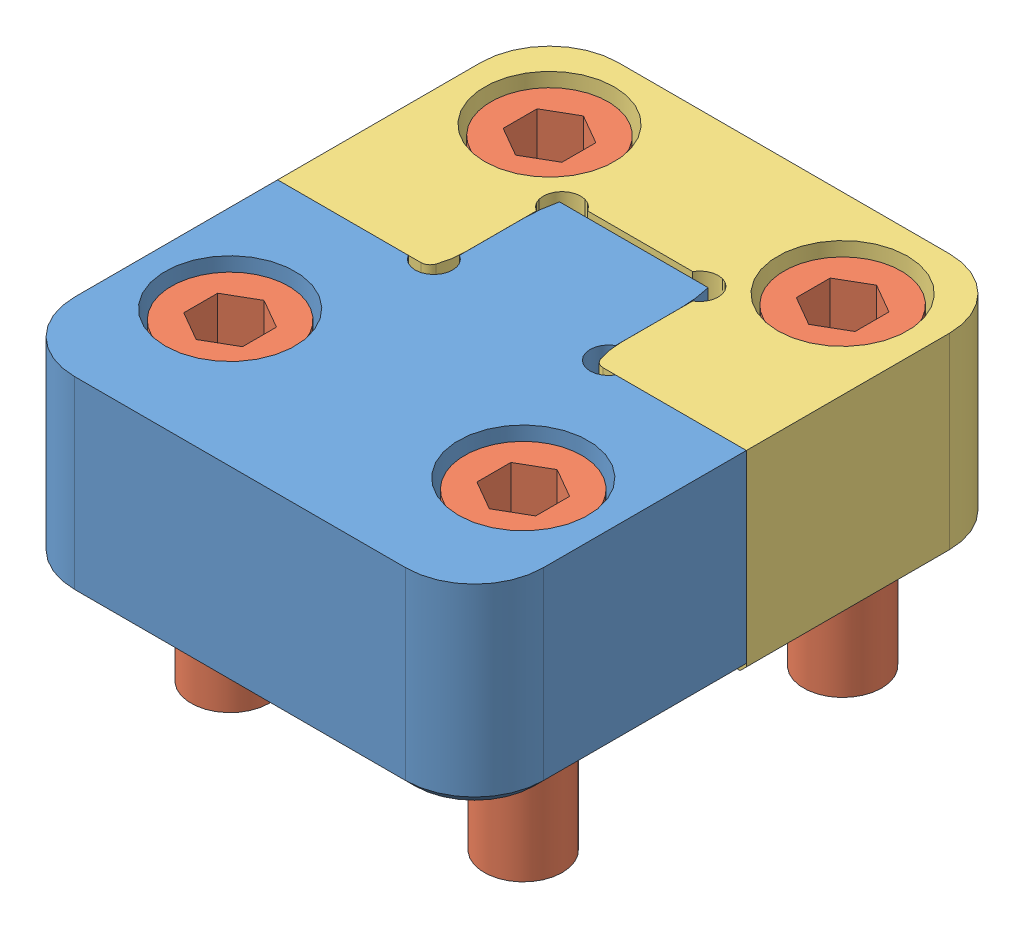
SolidWorks assembly SL62X150.SLDASM, configuration Default (file format 13000). Lengths in mm.
Overall size (38.1 26.2 44.2).
8 component instances, 3 part files, 6 mates.
Components (placement in the parent):
- SL62X150-M-1: SL62X150-M.SLDASM [Default] at origin size (38.1 26.2 32)
  - SL62X150 MALE-1: SL62X150 MALE.sldprt [Default] at origin size (38.1 15.75 32)
  - SHCS25-20L.75-1: SHCS25-20L.75.sldprt [SHCS25-20L.75] at (11.9126 -7.145 10.9982) x (1 0 0) z (0 -1 0) size (9.53 9.53 25.4)
  - SHCS25-20L.75-2: SHCS25-20L.75.sldprt [SHCS25-20L.75] at (-11.9126 -7.145 10.9982) x (1 0 0) z (0 -1 0) size (9.53 9.53 25.4)
- SL62X150-F-1: SL62X150-F.SLDASM [Default] at origin size (38.1 26.19 22.1)
  - SL62X150 FEMALE-1: SL62X150 FEMALE.sldprt [Default] at origin size (38.1 15.75 22.1)
  - SHCS25-20L.75-1: SHCS25-20L.75.sldprt [SHCS25-20L.75] at (11.9126 -7.1437 -14.9606) x (1 0 0) z (0 -1 0) size (9.53 9.53 25.4)
  - SHCS25-20L.75-2: SHCS25-20L.75.sldprt [SHCS25-20L.75] at (-11.9126 -7.1437 -14.9606) x (1 0 0) z (0 -1 0) size (9.53 9.53 25.4)
Mates (geometry in assembly coordinates):
- Coincident7: coincident aligned: plane of SLC62X150-M-1/SLC62X150 MALE-1 through (0 0 0) normal (0 1 0); plane of assembly through (0 0 0) normal (0 1 0)
- Coincident8: coincident aligned: plane of SLC62X150-M-1/SLC62X150 MALE-1 through (0 0 0) normal (0 0 1); plane of assembly through (0 0 0) normal (0 0 1)
- Coincident9: coincident aligned: plane of SLC62X150-M-1/SLC62X150 MALE-1 through (0 0 0) normal (1 0 0); plane of assembly through (0 0 0) normal (1 0 0)
- Coincident10: coincident aligned: plane of SLC62X150-F-1/SLC62X150 FEMALE-1 through (0 0 0) normal (0 1 0); plane of assembly through (0 0 0) normal (0 1 0)
- Coincident11: coincident aligned: plane of SLC62X150-F-1/SLC62X150 FEMALE-1 through (0 0 0) normal (1 0 0); plane of assembly through (0 0 0) normal (1 0 0)
- Distance4: distance anti-aligned: plane of SLC62X150-M-1/SLC62X150 MALE-1 through (6.3475 -15.748 0) normal (0 0 -1); plane of SLC62X150-F-1/SLC62X150 FEMALE-1 through (6.35 -15.748 0) normal (0 0 1)
